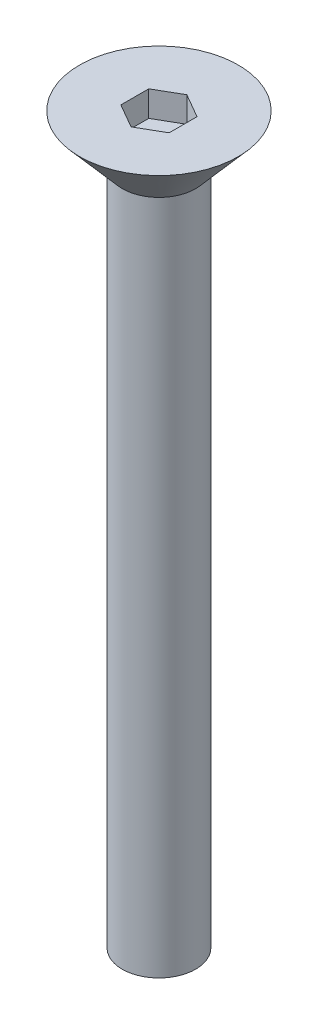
from build123d import *

# Parameters (mm, degrees)
HEXCUT_DEPTH = 1.68402


with BuildPart() as part:
    # Sketch1 → Screw (revolve)
    with BuildSketch(Plane.XY, mode=Mode.PRIVATE) as screw_sk:
        Polygon((0, 0), (5.2197, 0), (2.413, -3.228739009), (2.413, -47.678739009), (0, -47.678739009), align=None)
    revolve(screw_sk.sketch.rotate(Axis((0, 25.4, 0), (0, -1, 0)), 90), axis=Axis((0, 25.4, 0), (0, -1, 0)))

    # Sketch2 → HexCut (cut)
    with BuildSketch(Plane(origin=(0, 0, 0), x_dir=(-1, 0, 0), z_dir=(0, 1, 0))):
        Polygon((-1.5875, -0.916543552), (-1.5875, 0.916543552), (0, 1.833087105), (1.5875, 0.916543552), (1.5875, -0.916543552), (0, -1.833087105), align=None)
    extrude(amount=-HEXCUT_DEPTH, mode=Mode.SUBTRACT)


solid = part.part
